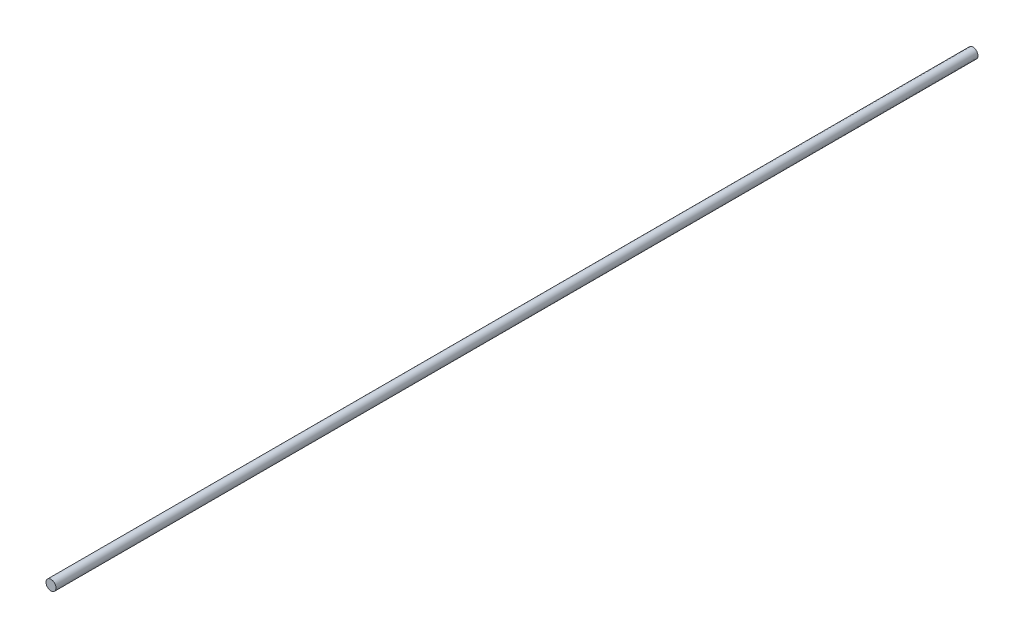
ISO-10303-21;
HEADER;
FILE_DESCRIPTION(('STEP AP214'),'2;1');
FILE_NAME('part.step','',(''),(''),'','','');
FILE_SCHEMA(('AUTOMOTIVE_DESIGN { 1 0 10303 214 1 1 1 1 }'));
ENDSEC;
DATA;
#1=APPLICATION_CONTEXT('core data for automotive mechanical design processes');
#2=APPLICATION_PROTOCOL_DEFINITION('international standard','automotive_design',2000,#1);
#3=PRODUCT_CONTEXT('',#1,'mechanical');
#4=PRODUCT('Part','Part','',(#3));
#5=PRODUCT_RELATED_PRODUCT_CATEGORY('part','',(#4));
#6=PRODUCT_DEFINITION_FORMATION('','',#4);
#7=PRODUCT_DEFINITION_CONTEXT('part definition',#1,'design');
#8=PRODUCT_DEFINITION('design','',#6,#7);
#9=PRODUCT_DEFINITION_SHAPE('','',#8);
#10=(LENGTH_UNIT() NAMED_UNIT(*) SI_UNIT(.MILLI.,.METRE.));
#11=(NAMED_UNIT(*) PLANE_ANGLE_UNIT() SI_UNIT($,.RADIAN.));
#12=(NAMED_UNIT(*) SI_UNIT($,.STERADIAN.) SOLID_ANGLE_UNIT());
#13=UNCERTAINTY_MEASURE_WITH_UNIT(LENGTH_MEASURE(1.E-05),#10,'distance_accuracy_value','');
#14=(GEOMETRIC_REPRESENTATION_CONTEXT(3) GLOBAL_UNCERTAINTY_ASSIGNED_CONTEXT((#13)) GLOBAL_UNIT_ASSIGNED_CONTEXT((#10,
#11,#12)) REPRESENTATION_CONTEXT('',''));
#15=CARTESIAN_POINT('',(0.,0.,0.));
#16=DIRECTION('',(0.,0.,1.));
#17=DIRECTION('',(1.,0.,0.));
#18=AXIS2_PLACEMENT_3D('',#15,#16,#17);
#19=CARTESIAN_POINT('',(0.,0.,584.2));
#20=DIRECTION('',(0.,0.,-1.));
#21=DIRECTION('',(-1.,0.,0.));
#22=AXIS2_PLACEMENT_3D('',#19,#20,#21);
#23=CYLINDRICAL_SURFACE('',#22,6.35);
#24=CARTESIAN_POINT('',(0.,0.,584.2));
#25=DIRECTION('',(0.,0.,1.));
#26=DIRECTION('',(1.,0.,0.));
#27=AXIS2_PLACEMENT_3D('',#24,#25,#26);
#28=CIRCLE('',#27,6.35);
#29=CARTESIAN_POINT('',(6.35,0.,584.2));
#30=VERTEX_POINT('',#29);
#31=EDGE_CURVE('E10',#30,#30,#28,.T.);
#32=ORIENTED_EDGE('',*,*,#31,.F.);
#33=EDGE_LOOP('',(#32));
#34=FACE_BOUND('',#33,.T.);
#35=CARTESIAN_POINT('',(0.,0.,-584.2));
#36=DIRECTION('',(0.,0.,1.));
#37=DIRECTION('',(1.,0.,0.));
#38=AXIS2_PLACEMENT_3D('',#35,#36,#37);
#39=CIRCLE('',#38,6.35);
#40=CARTESIAN_POINT('',(6.35,0.,-584.2));
#41=VERTEX_POINT('',#40);
#42=EDGE_CURVE('E33',#41,#41,#39,.T.);
#43=ORIENTED_EDGE('',*,*,#42,.T.);
#44=EDGE_LOOP('',(#43));
#45=FACE_BOUND('',#44,.T.);
#46=ADVANCED_FACE('F30',(#34,#45),#23,.T.);
#47=CARTESIAN_POINT('',(0.,0.,584.2));
#48=DIRECTION('',(0.,0.,1.));
#49=DIRECTION('',(1.,0.,0.));
#50=AXIS2_PLACEMENT_3D('',#47,#48,#49);
#51=PLANE('',#50);
#52=ORIENTED_EDGE('',*,*,#31,.T.);
#53=EDGE_LOOP('',(#52));
#54=FACE_BOUND('',#53,.T.);
#55=ADVANCED_FACE('F45',(#54),#51,.T.);
#56=CARTESIAN_POINT('',(0.,0.,-584.2));
#57=DIRECTION('',(0.,0.,1.));
#58=DIRECTION('',(1.,0.,0.));
#59=AXIS2_PLACEMENT_3D('',#56,#57,#58);
#60=PLANE('',#59);
#61=ORIENTED_EDGE('',*,*,#42,.F.);
#62=EDGE_LOOP('',(#61));
#63=FACE_BOUND('',#62,.T.);
#64=ADVANCED_FACE('F43',(#63),#60,.F.);
#65=CLOSED_SHELL('',(#46,#55,#64));
#66=MANIFOLD_SOLID_BREP('B2',#65);
#67=ADVANCED_BREP_SHAPE_REPRESENTATION('',(#18,#66),#14);
#68=SHAPE_DEFINITION_REPRESENTATION(#9,#67);
ENDSEC;
END-ISO-10303-21;
